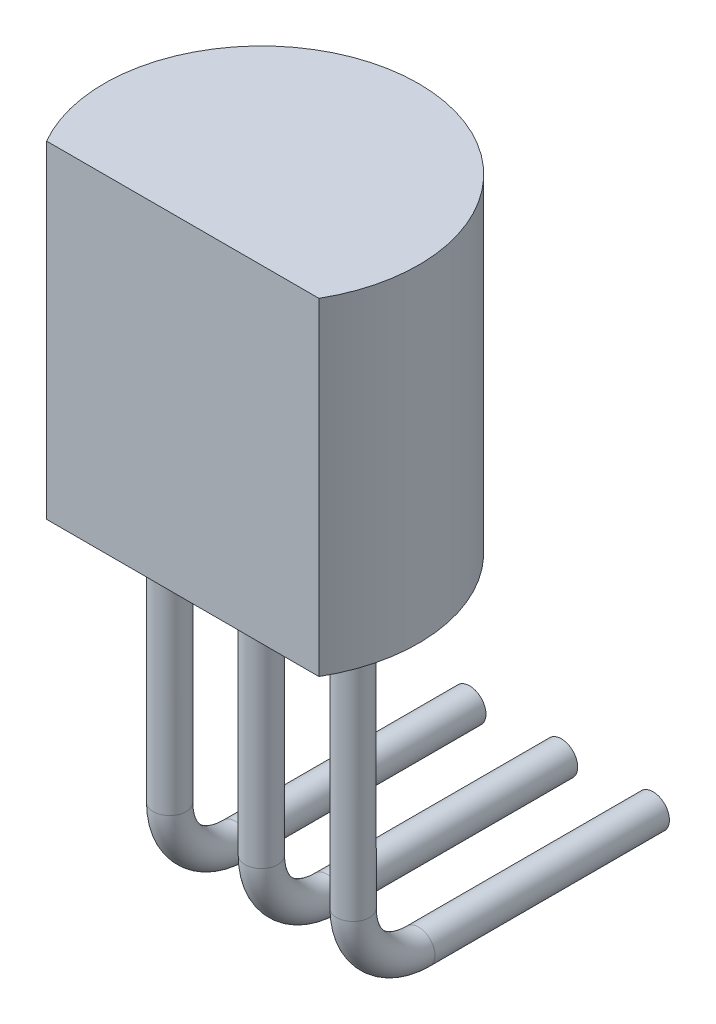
from build123d import *

# Parameters (mm, degrees)
EXTRUSION1_DEPTH = 5
ESQUISSE6_R      = 0.25


with BuildPart() as part:
    # Esquisse2 → Extrusion1 (new body)
    with BuildSketch(Plane(origin=(0, 0, 0), x_dir=(1, 0, 0), z_dir=(0, 1, 0))):
        with BuildLine():
            Line((-2.078460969, -1.2), (2.078460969, -1.2))
            ThreePointArc((2.078460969, -1.2), (0, 2.4), (-2.078460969, -1.2))
        make_face()
    extrude(amount=EXTRUSION1_DEPTH)

    # Balayage1: sweep along a path in Esquisse8
    with BuildLine(Plane(origin=(0, 0, 0), x_dir=(0, 0, -1), z_dir=(1, 0, 0))) as balayage1_path:
        Line((0, 0), (0, -4))
        ThreePointArc((0, -4), (0.292893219, -4.707106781), (1, -5))
        Line((1, -5), (4.578130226, -5))
    # Esquisse6 → Balayage1 (sweep)
    with BuildSketch(Plane.XZ):
        Circle(ESQUISSE6_R)
        with Locations((1.4, 0)):
            Circle(ESQUISSE6_R)
        with Locations((-1.4, 0)):
            Circle(ESQUISSE6_R)
    sweep(path=balayage1_path.line)


solid = part.part
